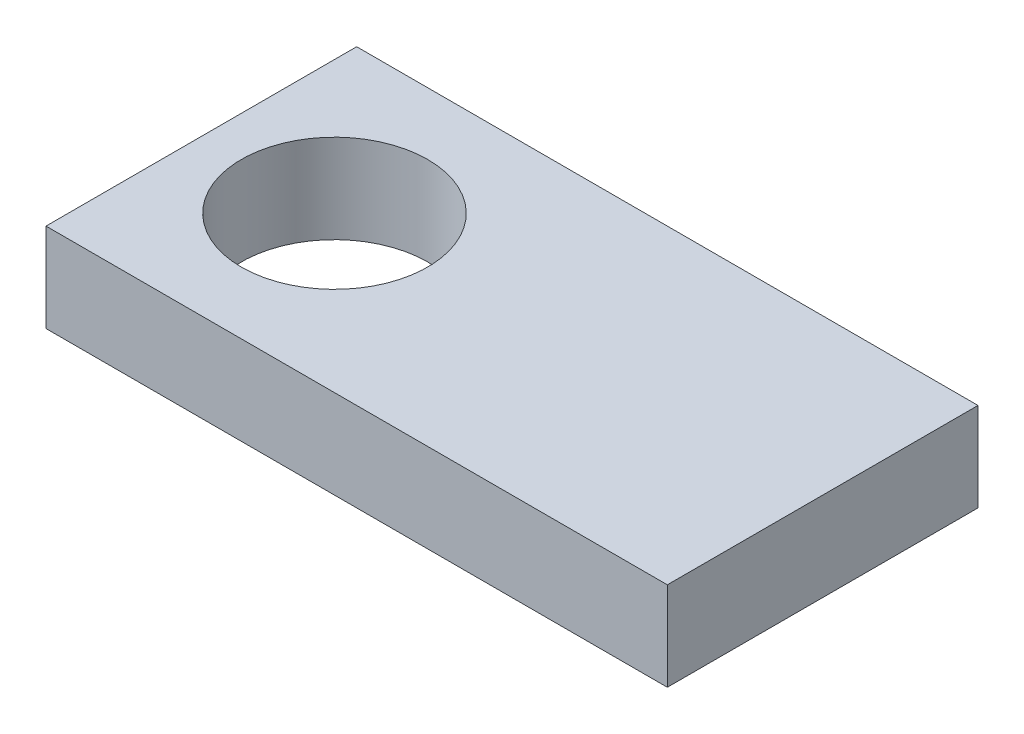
from build123d import *

# Parameters (mm, degrees)
ESQUISSE1_W             = 140
ESQUISSE1_H             = 20
BASE_EXTRUSION_DEPTH    = 70
ESQUISSE2_R             = 21
ENL_V_MAT_EXTRU_1_DEPTH = 158.797338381


with BuildPart() as part:
    # Esquisse1 → Base-Extrusion (new body)
    with BuildSketch(Plane.XY):
        with Locations((70, 10)):
            Rectangle(ESQUISSE1_W, ESQUISSE1_H)
    extrude(amount=BASE_EXTRUSION_DEPTH)

    # Esquisse2 → Enl_v. mat.-Extru.1 (cut, through all)
    with BuildSketch(Plane(origin=(0, 20, 0), x_dir=(-1, 0, 0), z_dir=(0, 1, 0))):
        with Locations(Location((-30, 35, 0), (0, 0, 90))):
            Circle(ESQUISSE2_R)
    extrude(amount=-ENL_V_MAT_EXTRU_1_DEPTH, mode=Mode.SUBTRACT)


solid = part.part
